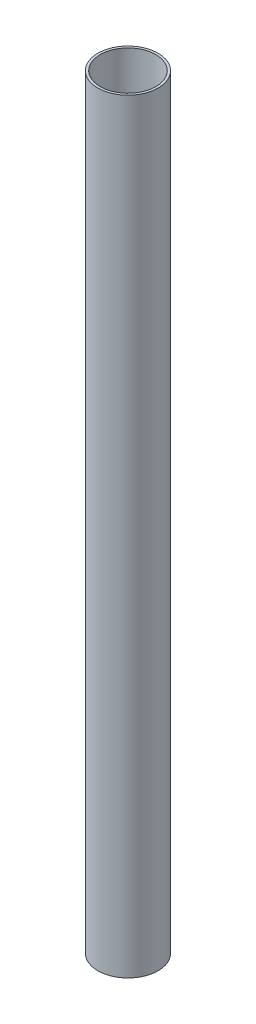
ISO-10303-21;
HEADER;
FILE_DESCRIPTION(('STEP AP214'),'2;1');
FILE_NAME('part.step','',(''),(''),'','','');
FILE_SCHEMA(('AUTOMOTIVE_DESIGN { 1 0 10303 214 1 1 1 1 }'));
ENDSEC;
DATA;
#1=APPLICATION_CONTEXT('core data for automotive mechanical design processes');
#2=APPLICATION_PROTOCOL_DEFINITION('international standard','automotive_design',2000,#1);
#3=PRODUCT_CONTEXT('',#1,'mechanical');
#4=PRODUCT('Part','Part','',(#3));
#5=PRODUCT_RELATED_PRODUCT_CATEGORY('part','',(#4));
#6=PRODUCT_DEFINITION_FORMATION('','',#4);
#7=PRODUCT_DEFINITION_CONTEXT('part definition',#1,'design');
#8=PRODUCT_DEFINITION('design','',#6,#7);
#9=PRODUCT_DEFINITION_SHAPE('','',#8);
#10=(LENGTH_UNIT() NAMED_UNIT(*) SI_UNIT(.MILLI.,.METRE.));
#11=(NAMED_UNIT(*) PLANE_ANGLE_UNIT() SI_UNIT($,.RADIAN.));
#12=(NAMED_UNIT(*) SI_UNIT($,.STERADIAN.) SOLID_ANGLE_UNIT());
#13=UNCERTAINTY_MEASURE_WITH_UNIT(LENGTH_MEASURE(1.E-05),#10,'distance_accuracy_value','');
#14=(GEOMETRIC_REPRESENTATION_CONTEXT(3) GLOBAL_UNCERTAINTY_ASSIGNED_CONTEXT((#13)) GLOBAL_UNIT_ASSIGNED_CONTEXT((#10,
#11,#12)) REPRESENTATION_CONTEXT('',''));
#15=CARTESIAN_POINT('',(0.,0.,0.));
#16=DIRECTION('',(0.,0.,1.));
#17=DIRECTION('',(1.,0.,0.));
#18=AXIS2_PLACEMENT_3D('',#15,#16,#17);
#19=CARTESIAN_POINT('',(0.,-330.,0.));
#20=DIRECTION('',(0.,1.,0.));
#21=DIRECTION('',(0.,0.,1.));
#22=AXIS2_PLACEMENT_3D('',#19,#20,#21);
#23=CYLINDRICAL_SURFACE('',#22,13.);
#24=CARTESIAN_POINT('',(0.,-330.,0.));
#25=DIRECTION('',(0.,1.,0.));
#26=DIRECTION('',(0.,0.,1.));
#27=AXIS2_PLACEMENT_3D('',#24,#25,#26);
#28=CIRCLE('',#27,13.);
#29=CARTESIAN_POINT('',(0.,-330.,13.));
#30=VERTEX_POINT('',#29);
#31=EDGE_CURVE('E10',#30,#30,#28,.T.);
#32=ORIENTED_EDGE('',*,*,#31,.T.);
#33=EDGE_LOOP('',(#32));
#34=FACE_BOUND('',#33,.T.);
#35=CARTESIAN_POINT('',(0.,0.,0.));
#36=DIRECTION('',(0.,1.,0.));
#37=DIRECTION('',(0.,0.,1.));
#38=AXIS2_PLACEMENT_3D('',#35,#36,#37);
#39=CIRCLE('',#38,13.);
#40=CARTESIAN_POINT('',(0.,0.,13.));
#41=VERTEX_POINT('',#40);
#42=EDGE_CURVE('E40',#41,#41,#39,.T.);
#43=ORIENTED_EDGE('',*,*,#42,.F.);
#44=EDGE_LOOP('',(#43));
#45=FACE_BOUND('',#44,.T.);
#46=ADVANCED_FACE('F37',(#34,#45),#23,.T.);
#47=CARTESIAN_POINT('',(0.,-330.,0.));
#48=DIRECTION('',(0.,1.,0.));
#49=DIRECTION('',(0.,0.,1.));
#50=AXIS2_PLACEMENT_3D('',#47,#48,#49);
#51=PLANE('',#50);
#52=CARTESIAN_POINT('',(0.,-330.,0.));
#53=DIRECTION('',(0.,1.,0.));
#54=DIRECTION('',(0.,0.,1.));
#55=AXIS2_PLACEMENT_3D('',#52,#53,#54);
#56=CIRCLE('',#55,12.);
#57=CARTESIAN_POINT('',(0.,-330.,12.));
#58=VERTEX_POINT('',#57);
#59=EDGE_CURVE('E47',#58,#58,#56,.T.);
#60=ORIENTED_EDGE('',*,*,#59,.T.);
#61=EDGE_LOOP('',(#60));
#62=FACE_BOUND('',#61,.T.);
#63=ORIENTED_EDGE('',*,*,#31,.F.);
#64=EDGE_LOOP('',(#63));
#65=FACE_BOUND('',#64,.T.);
#66=ADVANCED_FACE('F55',(#62,#65),#51,.F.);
#67=CARTESIAN_POINT('',(0.,0.,0.));
#68=DIRECTION('',(0.,1.,0.));
#69=DIRECTION('',(0.,0.,1.));
#70=AXIS2_PLACEMENT_3D('',#67,#68,#69);
#71=PLANE('',#70);
#72=CARTESIAN_POINT('',(0.,0.,0.));
#73=DIRECTION('',(0.,1.,0.));
#74=DIRECTION('',(0.,0.,1.));
#75=AXIS2_PLACEMENT_3D('',#72,#73,#74);
#76=CIRCLE('',#75,12.);
#77=CARTESIAN_POINT('',(0.,0.,12.));
#78=VERTEX_POINT('',#77);
#79=EDGE_CURVE('E49',#78,#78,#76,.T.);
#80=ORIENTED_EDGE('',*,*,#79,.F.);
#81=EDGE_LOOP('',(#80));
#82=FACE_BOUND('',#81,.T.);
#83=ORIENTED_EDGE('',*,*,#42,.T.);
#84=EDGE_LOOP('',(#83));
#85=FACE_BOUND('',#84,.T.);
#86=ADVANCED_FACE('F61',(#82,#85),#71,.T.);
#87=CARTESIAN_POINT('',(0.,-330.,0.));
#88=DIRECTION('',(0.,1.,0.));
#89=DIRECTION('',(0.,0.,1.));
#90=AXIS2_PLACEMENT_3D('',#87,#88,#89);
#91=CYLINDRICAL_SURFACE('',#90,12.);
#92=ORIENTED_EDGE('',*,*,#59,.F.);
#93=EDGE_LOOP('',(#92));
#94=FACE_BOUND('',#93,.T.);
#95=ORIENTED_EDGE('',*,*,#79,.T.);
#96=EDGE_LOOP('',(#95));
#97=FACE_BOUND('',#96,.T.);
#98=ADVANCED_FACE('F58',(#94,#97),#91,.F.);
#99=CLOSED_SHELL('',(#46,#66,#86,#98));
#100=MANIFOLD_SOLID_BREP('B2',#99);
#101=ADVANCED_BREP_SHAPE_REPRESENTATION('',(#18,#100),#14);
#102=SHAPE_DEFINITION_REPRESENTATION(#9,#101);
ENDSEC;
END-ISO-10303-21;
